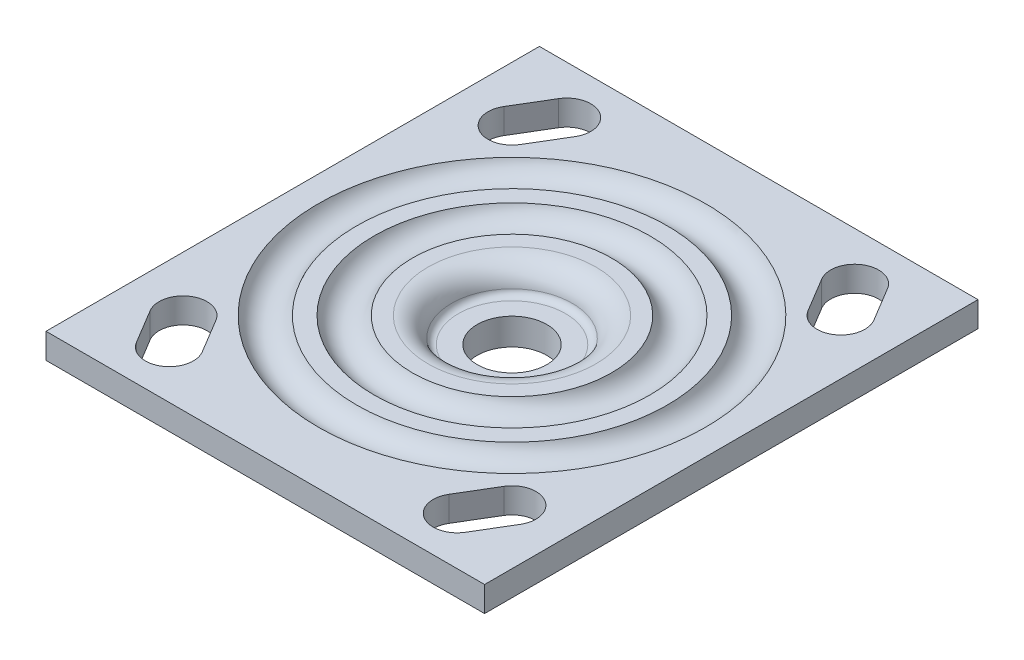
from build123d import *

# Parameters (mm, degrees)
EXTRUDE1_START     = -5.842
SKETCH9_W          = 101.6
SKETCH9_H          = 114.3
SKETCH9_R          = 47.625
EXTRUDE1_DEPTH     = 5.842
CUT_EXTRUDE3_DEPTH = 5.842


with BuildPart() as part:
    # Sketch7 → Revolve3 (revolve)
    with BuildSketch(Plane.XY, mode=Mode.PRIVATE) as revolve3_sk:
        with BuildLine():
            Line((47.625, 0), (47.625, -5.842))
            Line((47.625, -5.842), (44.731389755, -5.842))
            ThreePointArc((44.731389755, -5.842), (44.108231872, -6.033036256), (43.699207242, -6.5405))
            ThreePointArc((43.699207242, -6.5405), (43.290182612, -7.047963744), (42.667024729, -7.239))
            Line((42.667024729, -7.239), (36.826751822, -7.239))
            ThreePointArc((36.826751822, -7.239), (33.4518, -5.842), (30.076848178, -7.239))
            Line((30.076848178, -7.239), (25.99071008, -7.239))
            ThreePointArc((25.99071008, -7.239), (22.277960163, -5.902439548), (19.247311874, -8.42950835))
            ThreePointArc((19.247311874, -8.42950835), (17.217748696, -11.048352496), (14.05627756, -12.0396))
            Line((14.05627756, -12.0396), (8.0645, -12.0396))
            Line((8.0645, -12.0396), (8.0645, -5.842))
            Line((8.0645, -5.842), (12.417552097, -5.842))
            ThreePointArc((12.417552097, -5.842), (13.432669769, -5.475029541), (13.978473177, -4.543777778))
            ThreePointArc((13.978473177, -4.543777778), (15.888785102, -1.284396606), (19.441696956, 0))
            Line((19.441696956, 0), (23.056724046, 0))
            ThreePointArc((23.056724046, 0), (27.498675, -3.0226), (31.940625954, 0))
            Line((31.940625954, 0), (35.973120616, 0))
            ThreePointArc((35.973120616, 0), (40.41507157, -3.0226), (44.857022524, 0))
            Line((44.857022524, 0), (47.625, 0))
        make_face()
    revolve(revolve3_sk.sketch.rotate(Axis((0, 0, 0), (0, -1, 0)), 90), axis=Axis((0, 0, 0), (0, -1, 0)))

    # Sketch9 → Extrude1 (add)
    with BuildSketch(Plane(origin=(0, 0, 0), x_dir=(1, 0, 0), z_dir=(0, 1, 0)).offset(EXTRUDE1_START)):
        Rectangle(SKETCH9_W, SKETCH9_H)
        Circle(SKETCH9_R, mode=Mode.SUBTRACT)
    extrude(amount=EXTRUDE1_DEPTH)

    # Sketch10 → Cut-Extrude3 (cut)
    with BuildSketch(Plane(origin=(0, 0, 0), x_dir=(-1, 0, 0), z_dir=(0, 1, 0))):
        with BuildLine():
            Line((42.864445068, 40.958667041), (38.101945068, 48.896167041))
            ThreePointArc((38.101945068, 48.896167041), (30.478832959, 50.801945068), (28.573054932, 43.178832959))
            Line((28.573054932, 43.178832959), (33.335554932, 35.241332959))
            ThreePointArc((33.335554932, 35.241332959), (40.958667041, 33.335554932), (42.864445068, 40.958667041))
        make_face()
        with BuildLine():
            Line((33.335554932, -35.241332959), (28.573054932, -43.178832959))
            ThreePointArc((28.573054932, -43.178832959), (30.478832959, -50.801945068), (38.101945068, -48.896167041))
            Line((38.101945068, -48.896167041), (42.864445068, -40.958667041))
            ThreePointArc((42.864445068, -40.958667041), (40.958667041, -33.335554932), (33.335554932, -35.241332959))
        make_face()
        with BuildLine():
            Line((-38.101945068, -48.896167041), (-42.864445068, -40.958667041))
            ThreePointArc((-42.864445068, -40.958667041), (-40.958667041, -33.335554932), (-33.335554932, -35.241332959))
            Line((-33.335554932, -35.241332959), (-28.573054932, -43.178832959))
            ThreePointArc((-28.573054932, -43.178832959), (-30.478832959, -50.801945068), (-38.101945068, -48.896167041))
        make_face()
        with BuildLine():
            Line((-42.864445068, 40.958667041), (-38.101945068, 48.896167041))
            ThreePointArc((-38.101945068, 48.896167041), (-30.478832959, 50.801945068), (-28.573054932, 43.178832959))
            Line((-28.573054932, 43.178832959), (-33.335554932, 35.241332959))
            ThreePointArc((-33.335554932, 35.241332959), (-40.958667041, 33.335554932), (-42.864445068, 40.958667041))
        make_face()
    extrude(amount=-CUT_EXTRUDE3_DEPTH, mode=Mode.SUBTRACT)


solid = part.part
